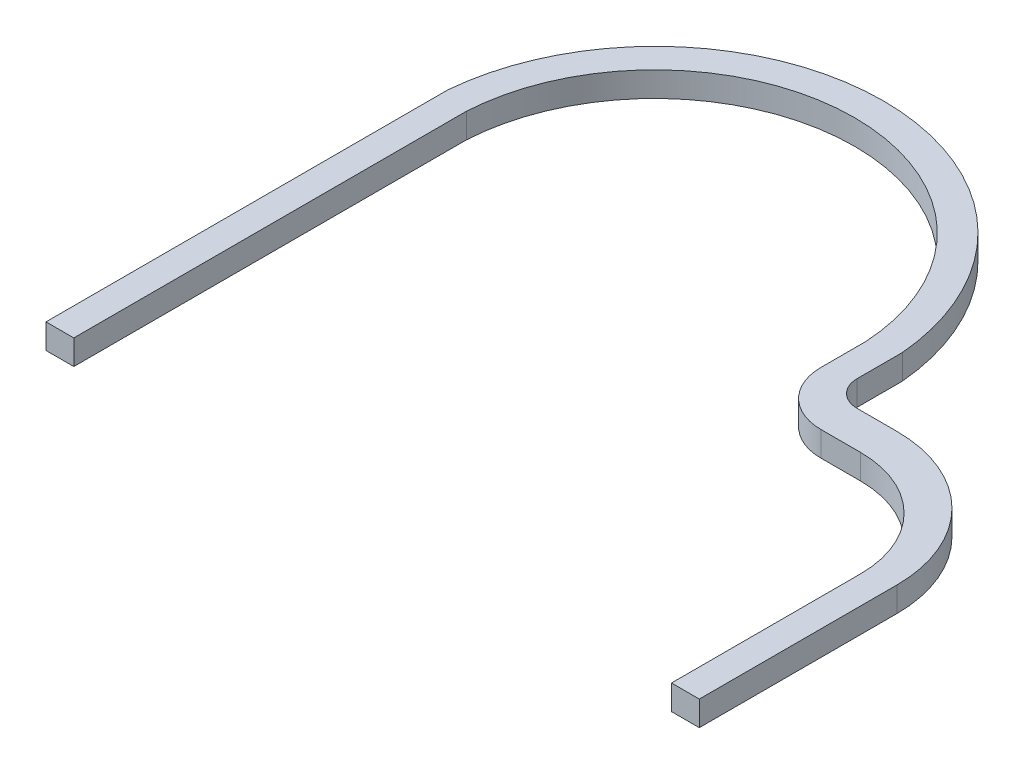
from build123d import *

# Parameters (mm, degrees)
RIM_DEPTH = 3.175


with BuildPart() as part:
    # Sketch2 → rim (new body)
    with BuildSketch(Plane(origin=(0, 0, 0), x_dir=(1, 0, 0), z_dir=(0, 1, 0))):
        with BuildLine():
            Line((3.302, -35.433), (6.858, -35.433))
            Line((6.858, -35.433), (6.858, -10.16))
            ThreePointArc((6.858, -10.16), (1.873543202, 1.873543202), (-10.16, 6.858))
            Line((-10.16, 6.858), (-15.24, 6.858))
            ThreePointArc((-15.24, 6.858), (-17.574866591, 7.825133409), (-18.542, 10.16))
            Line((-18.542, 10.16), (-18.542, 15.953751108))
            ThreePointArc((-18.542, 15.953751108), (-47.625, 42.606368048), (-76.708, 15.953751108))
            Line((-76.708, 15.953751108), (-76.708, -35.433))
            Line((-76.708, -35.433), (-73.152, -35.433))
            Line((-73.152, -35.433), (-73.152, 14.778504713))
            ThreePointArc((-73.152, 14.778504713), (-47.625, 38.902781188), (-22.098, 14.778504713))
            Line((-22.098, 14.778504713), (-22.098, 9.063504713))
            ThreePointArc((-22.098, 9.063504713), (-20.089338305, 4.214166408), (-15.24, 2.205504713))
            Line((-15.24, 2.205504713), (-10.16, 2.205504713))
            ThreePointArc((-10.16, 2.205504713), (-0.640928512, -1.737423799), (3.302, -11.256495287))
            Line((3.302, -11.256495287), (3.302, -35.433))
        make_face()
    extrude(amount=RIM_DEPTH)


solid = part.part
